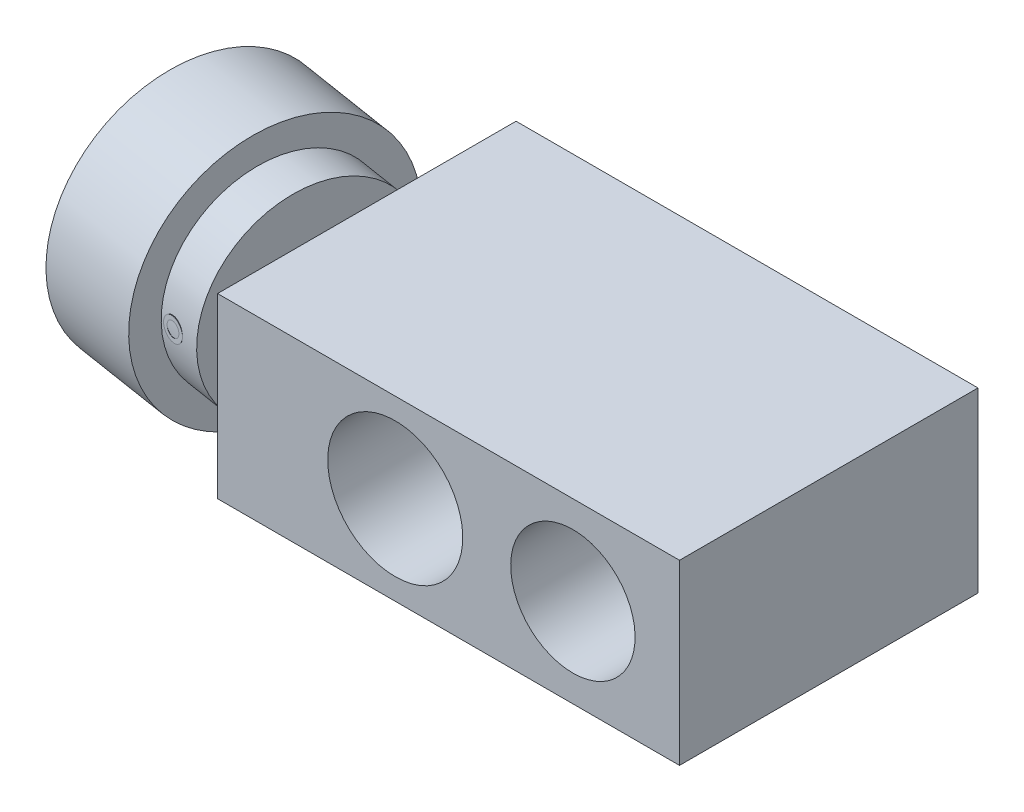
ISO-10303-21;
HEADER;
FILE_DESCRIPTION(('STEP AP214'),'2;1');
FILE_NAME('part.step','',(''),(''),'','','');
FILE_SCHEMA(('AUTOMOTIVE_DESIGN { 1 0 10303 214 1 1 1 1 }'));
ENDSEC;
DATA;
#1=APPLICATION_CONTEXT('core data for automotive mechanical design processes');
#2=APPLICATION_PROTOCOL_DEFINITION('international standard','automotive_design',2000,#1);
#3=PRODUCT_CONTEXT('',#1,'mechanical');
#4=PRODUCT('Part','Part','',(#3));
#5=PRODUCT_RELATED_PRODUCT_CATEGORY('part','',(#4));
#6=PRODUCT_DEFINITION_FORMATION('','',#4);
#7=PRODUCT_DEFINITION_CONTEXT('part definition',#1,'design');
#8=PRODUCT_DEFINITION('design','',#6,#7);
#9=PRODUCT_DEFINITION_SHAPE('','',#8);
#10=(LENGTH_UNIT() NAMED_UNIT(*) SI_UNIT(.MILLI.,.METRE.));
#11=(NAMED_UNIT(*) PLANE_ANGLE_UNIT() SI_UNIT($,.RADIAN.));
#12=(NAMED_UNIT(*) SI_UNIT($,.STERADIAN.) SOLID_ANGLE_UNIT());
#13=UNCERTAINTY_MEASURE_WITH_UNIT(LENGTH_MEASURE(1.E-05),#10,'distance_accuracy_value','');
#14=(GEOMETRIC_REPRESENTATION_CONTEXT(3) GLOBAL_UNCERTAINTY_ASSIGNED_CONTEXT((#13)) GLOBAL_UNIT_ASSIGNED_CONTEXT((#10,
#11,#12)) REPRESENTATION_CONTEXT('',''));
#15=CARTESIAN_POINT('',(0.,0.,0.));
#16=DIRECTION('',(0.,0.,1.));
#17=DIRECTION('',(1.,0.,0.));
#18=AXIS2_PLACEMENT_3D('',#15,#16,#17);
#19=CARTESIAN_POINT('',(-25.,-13.11,22.));
#20=DIRECTION('',(0.,1.,0.));
#21=DIRECTION('',(-1.,0.,0.));
#22=AXIS2_PLACEMENT_3D('',#19,#20,#21);
#23=PLANE('',#22);
#24=DIRECTION('',(0.,0.,1.));
#25=VECTOR('',#24,1.);
#26=CARTESIAN_POINT('',(-26.,-13.11,21.4226497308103));
#27=LINE('',#26,#25);
#28=CARTESIAN_POINT('',(-26.,-13.11,21.4226497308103));
#29=VERTEX_POINT('',#28);
#30=CARTESIAN_POINT('',(-26.,-13.11,22.5773502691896));
#31=VERTEX_POINT('',#30);
#32=EDGE_CURVE('E807',#29,#31,#27,.T.);
#33=ORIENTED_EDGE('',*,*,#32,.F.);
#34=DIRECTION('',(-0.866025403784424,0.,0.50000000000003));
#35=VECTOR('',#34,1.);
#36=CARTESIAN_POINT('',(-25.,-13.11,20.8452994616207));
#37=LINE('',#36,#35);
#38=CARTESIAN_POINT('',(-25.,-13.11,20.8452994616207));
#39=VERTEX_POINT('',#38);
#40=EDGE_CURVE('E809',#39,#29,#37,.T.);
#41=ORIENTED_EDGE('',*,*,#40,.F.);
#42=DIRECTION('',(-0.866025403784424,0.,-0.50000000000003));
#43=VECTOR('',#42,1.);
#44=CARTESIAN_POINT('',(-24.,-13.11,21.4226497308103));
#45=LINE('',#44,#43);
#46=CARTESIAN_POINT('',(-24.,-13.11,21.4226497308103));
#47=VERTEX_POINT('',#46);
#48=EDGE_CURVE('E812',#47,#39,#45,.T.);
#49=ORIENTED_EDGE('',*,*,#48,.F.);
#50=DIRECTION('',(0.,0.,-1.));
#51=VECTOR('',#50,1.);
#52=CARTESIAN_POINT('',(-24.,-13.11,22.5773502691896));
#53=LINE('',#52,#51);
#54=CARTESIAN_POINT('',(-24.,-13.11,22.5773502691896));
#55=VERTEX_POINT('',#54);
#56=EDGE_CURVE('E815',#55,#47,#53,.T.);
#57=ORIENTED_EDGE('',*,*,#56,.F.);
#58=DIRECTION('',(0.866025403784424,0.,-0.50000000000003));
#59=VECTOR('',#58,1.);
#60=CARTESIAN_POINT('',(-25.,-13.11,23.1547005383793));
#61=LINE('',#60,#59);
#62=CARTESIAN_POINT('',(-25.,-13.11,23.1547005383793));
#63=VERTEX_POINT('',#62);
#64=EDGE_CURVE('E33',#63,#55,#61,.T.);
#65=ORIENTED_EDGE('',*,*,#64,.F.);
#66=DIRECTION('',(0.866025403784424,0.,0.50000000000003));
#67=VECTOR('',#66,1.);
#68=CARTESIAN_POINT('',(-26.,-13.11,22.5773502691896));
#69=LINE('',#68,#67);
#70=EDGE_CURVE('E805',#31,#63,#69,.T.);
#71=ORIENTED_EDGE('',*,*,#70,.F.);
#72=EDGE_LOOP('',(#33,#41,#49,#57,#65,#71));
#73=FACE_BOUND('',#72,.T.);
#74=ADVANCED_FACE('F14',(#73),#23,.F.);
#75=CARTESIAN_POINT('',(-24.,-13.11,22.5773502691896));
#76=DIRECTION('',(-1.,0.,0.));
#77=DIRECTION('',(0.,-1.,0.));
#78=AXIS2_PLACEMENT_3D('',#75,#76,#77);
#79=PLANE('',#78);
#80=DIRECTION('',(0.,-1.,0.));
#81=VECTOR('',#80,1.);
#82=CARTESIAN_POINT('',(-24.,-13.11,22.5773502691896));
#83=LINE('',#82,#81);
#84=CARTESIAN_POINT('',(-24.,-14.15,22.5773502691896));
#85=VERTEX_POINT('',#84);
#86=EDGE_CURVE('E787',#55,#85,#83,.T.);
#87=ORIENTED_EDGE('',*,*,#86,.F.);
#88=ORIENTED_EDGE('',*,*,#56,.T.);
#89=DIRECTION('',(0.,-1.,0.));
#90=VECTOR('',#89,1.);
#91=CARTESIAN_POINT('',(-24.,-13.11,21.4226497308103));
#92=LINE('',#91,#90);
#93=CARTESIAN_POINT('',(-24.,-14.15,21.4226497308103));
#94=VERTEX_POINT('',#93);
#95=EDGE_CURVE('E790',#47,#94,#92,.T.);
#96=ORIENTED_EDGE('',*,*,#95,.T.);
#97=DIRECTION('',(0.,0.,1.));
#98=VECTOR('',#97,1.);
#99=CARTESIAN_POINT('',(-24.,-14.15,23.));
#100=LINE('',#99,#98);
#101=EDGE_CURVE('E24',#94,#85,#100,.T.);
#102=ORIENTED_EDGE('',*,*,#101,.T.);
#103=EDGE_LOOP('',(#87,#88,#96,#102));
#104=FACE_BOUND('',#103,.T.);
#105=ADVANCED_FACE('F492',(#104),#79,.T.);
#106=CARTESIAN_POINT('',(-25.,-13.11,23.1547005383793));
#107=DIRECTION('',(-0.50000000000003,0.,-0.866025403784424));
#108=DIRECTION('',(-0.866025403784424,0.,0.50000000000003));
#109=AXIS2_PLACEMENT_3D('',#106,#107,#108);
#110=PLANE('',#109);
#111=DIRECTION('',(0.,-1.,0.));
#112=VECTOR('',#111,1.);
#113=CARTESIAN_POINT('',(-25.,-13.11,23.1547005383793));
#114=LINE('',#113,#112);
#115=CARTESIAN_POINT('',(-25.,-14.15,23.1547005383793));
#116=VERTEX_POINT('',#115);
#117=EDGE_CURVE('E802',#63,#116,#114,.T.);
#118=ORIENTED_EDGE('',*,*,#117,.F.);
#119=ORIENTED_EDGE('',*,*,#64,.T.);
#120=ORIENTED_EDGE('',*,*,#86,.T.);
#121=DIRECTION('',(-0.866025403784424,0.,0.50000000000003));
#122=VECTOR('',#121,1.);
#123=CARTESIAN_POINT('',(-24.9330127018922,-14.15,23.1160254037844));
#124=LINE('',#123,#122);
#125=EDGE_CURVE('E778',#85,#116,#124,.T.);
#126=ORIENTED_EDGE('',*,*,#125,.T.);
#127=EDGE_LOOP('',(#118,#119,#120,#126));
#128=FACE_BOUND('',#127,.T.);
#129=ADVANCED_FACE('F520',(#128),#110,.T.);
#130=CARTESIAN_POINT('',(-26.,-13.11,22.5773502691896));
#131=DIRECTION('',(0.50000000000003,0.,-0.866025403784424));
#132=DIRECTION('',(-0.866025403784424,0.,-0.50000000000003));
#133=AXIS2_PLACEMENT_3D('',#130,#131,#132);
#134=PLANE('',#133);
#135=DIRECTION('',(0.,-1.,0.));
#136=VECTOR('',#135,1.);
#137=CARTESIAN_POINT('',(-26.,-13.11,22.5773502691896));
#138=LINE('',#137,#136);
#139=CARTESIAN_POINT('',(-26.,-14.15,22.5773502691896));
#140=VERTEX_POINT('',#139);
#141=EDGE_CURVE('E799',#31,#140,#138,.T.);
#142=ORIENTED_EDGE('',*,*,#141,.F.);
#143=ORIENTED_EDGE('',*,*,#70,.T.);
#144=ORIENTED_EDGE('',*,*,#117,.T.);
#145=DIRECTION('',(-0.866025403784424,0.,-0.50000000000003));
#146=VECTOR('',#145,1.);
#147=CARTESIAN_POINT('',(-25.0669872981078,-14.15,23.1160254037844));
#148=LINE('',#147,#146);
#149=EDGE_CURVE('E782',#116,#140,#148,.T.);
#150=ORIENTED_EDGE('',*,*,#149,.T.);
#151=EDGE_LOOP('',(#142,#143,#144,#150));
#152=FACE_BOUND('',#151,.T.);
#153=ADVANCED_FACE('F510',(#152),#134,.T.);
#154=CARTESIAN_POINT('',(-26.,-13.11,21.4226497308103));
#155=DIRECTION('',(1.,0.,0.));
#156=DIRECTION('',(0.,1.,0.));
#157=AXIS2_PLACEMENT_3D('',#154,#155,#156);
#158=PLANE('',#157);
#159=ORIENTED_EDGE('',*,*,#32,.T.);
#160=ORIENTED_EDGE('',*,*,#141,.T.);
#161=DIRECTION('',(0.,0.,-1.));
#162=VECTOR('',#161,1.);
#163=CARTESIAN_POINT('',(-26.,-14.15,23.));
#164=LINE('',#163,#162);
#165=CARTESIAN_POINT('',(-26.,-14.15,21.4226497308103));
#166=VERTEX_POINT('',#165);
#167=EDGE_CURVE('E780',#140,#166,#164,.T.);
#168=ORIENTED_EDGE('',*,*,#167,.T.);
#169=DIRECTION('',(0.,-1.,0.));
#170=VECTOR('',#169,1.);
#171=CARTESIAN_POINT('',(-26.,-13.11,21.4226497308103));
#172=LINE('',#171,#170);
#173=EDGE_CURVE('E796',#29,#166,#172,.T.);
#174=ORIENTED_EDGE('',*,*,#173,.F.);
#175=EDGE_LOOP('',(#159,#160,#168,#174));
#176=FACE_BOUND('',#175,.T.);
#177=ADVANCED_FACE('F500',(#176),#158,.T.);
#178=CARTESIAN_POINT('',(-25.,-13.11,20.8452994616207));
#179=DIRECTION('',(0.50000000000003,0.,0.866025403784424));
#180=DIRECTION('',(0.866025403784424,0.,-0.50000000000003));
#181=AXIS2_PLACEMENT_3D('',#178,#179,#180);
#182=PLANE('',#181);
#183=DIRECTION('',(0.,-1.,0.));
#184=VECTOR('',#183,1.);
#185=CARTESIAN_POINT('',(-25.,-13.11,20.8452994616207));
#186=LINE('',#185,#184);
#187=CARTESIAN_POINT('',(-25.,-14.15,20.8452994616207));
#188=VERTEX_POINT('',#187);
#189=EDGE_CURVE('E793',#39,#188,#186,.T.);
#190=ORIENTED_EDGE('',*,*,#189,.F.);
#191=ORIENTED_EDGE('',*,*,#40,.T.);
#192=ORIENTED_EDGE('',*,*,#173,.T.);
#193=DIRECTION('',(0.866025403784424,0.,-0.50000000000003));
#194=VECTOR('',#193,1.);
#195=CARTESIAN_POINT('',(-25.9330127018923,-14.15,21.3839745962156));
#196=LINE('',#195,#194);
#197=EDGE_CURVE('E776',#166,#188,#196,.T.);
#198=ORIENTED_EDGE('',*,*,#197,.T.);
#199=EDGE_LOOP('',(#190,#191,#192,#198));
#200=FACE_BOUND('',#199,.T.);
#201=ADVANCED_FACE('F489',(#200),#182,.T.);
#202=CARTESIAN_POINT('',(-24.,-13.11,21.4226497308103));
#203=DIRECTION('',(-0.50000000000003,0.,0.866025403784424));
#204=DIRECTION('',(0.866025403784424,0.,0.50000000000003));
#205=AXIS2_PLACEMENT_3D('',#202,#203,#204);
#206=PLANE('',#205);
#207=ORIENTED_EDGE('',*,*,#95,.F.);
#208=ORIENTED_EDGE('',*,*,#48,.T.);
#209=ORIENTED_EDGE('',*,*,#189,.T.);
#210=DIRECTION('',(0.866025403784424,0.,0.50000000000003));
#211=VECTOR('',#210,1.);
#212=CARTESIAN_POINT('',(-24.0669872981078,-14.15,21.3839745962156));
#213=LINE('',#212,#211);
#214=EDGE_CURVE('E9',#188,#94,#213,.T.);
#215=ORIENTED_EDGE('',*,*,#214,.T.);
#216=EDGE_LOOP('',(#207,#208,#209,#215));
#217=FACE_BOUND('',#216,.T.);
#218=ADVANCED_FACE('F480',(#217),#206,.T.);
#219=CARTESIAN_POINT('',(-25.,-14.15,23.));
#220=DIRECTION('',(0.,1.,0.));
#221=DIRECTION('',(-1.,0.,0.));
#222=AXIS2_PLACEMENT_3D('',#219,#220,#221);
#223=PLANE('',#222);
#224=CARTESIAN_POINT('',(-25.,-14.15,22.));
#225=DIRECTION('',(0.,1.,0.));
#226=DIRECTION('',(-1.,0.,0.));
#227=AXIS2_PLACEMENT_3D('',#224,#225,#226);
#228=CIRCLE('',#227,1.925);
#229=CARTESIAN_POINT('',(-26.925,-14.15,22.));
#230=VERTEX_POINT('',#229);
#231=EDGE_CURVE('E784',#230,#230,#228,.T.);
#232=ORIENTED_EDGE('',*,*,#231,.F.);
#233=EDGE_LOOP('',(#232));
#234=FACE_BOUND('',#233,.T.);
#235=ORIENTED_EDGE('',*,*,#214,.F.);
#236=ORIENTED_EDGE('',*,*,#197,.F.);
#237=ORIENTED_EDGE('',*,*,#167,.F.);
#238=ORIENTED_EDGE('',*,*,#149,.F.);
#239=ORIENTED_EDGE('',*,*,#125,.F.);
#240=ORIENTED_EDGE('',*,*,#101,.F.);
#241=EDGE_LOOP('',(#235,#236,#237,#238,#239,#240));
#242=FACE_BOUND('',#241,.T.);
#243=ADVANCED_FACE('F461',(#234,#242),#223,.F.);
#244=CARTESIAN_POINT('',(-25.,-12.0103137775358,22.));
#245=DIRECTION('',(0.,1.,0.));
#246=DIRECTION('',(-1.,0.,0.));
#247=AXIS2_PLACEMENT_3D('',#244,#245,#246);
#248=DEGENERATE_TOROIDAL_SURFACE('',#247,0.0423840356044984,2.84999999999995,.T.);
#249=ORIENTED_EDGE('',*,*,#231,.T.);
#250=EDGE_LOOP('',(#249));
#251=FACE_BOUND('',#250,.T.);
#252=CARTESIAN_POINT('',(-25.,-12.5,22.));
#253=DIRECTION('',(0.,-1.,0.));
#254=DIRECTION('',(0.,0.,-1.));
#255=AXIS2_PLACEMENT_3D('',#252,#253,#254);
#256=CIRCLE('',#255,2.85);
#257=CARTESIAN_POINT('',(-25.,-12.5,19.15));
#258=VERTEX_POINT('',#257);
#259=EDGE_CURVE('E226',#258,#258,#256,.F.);
#260=ORIENTED_EDGE('',*,*,#259,.F.);
#261=EDGE_LOOP('',(#260));
#262=FACE_BOUND('',#261,.T.);
#263=ADVANCED_FACE('F466',(#251,#262),#248,.T.);
#264=CARTESIAN_POINT('',(-65.3046702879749,0.,27.2383039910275));
#265=DIRECTION('',(-0.987688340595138,0.,-0.156434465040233));
#266=DIRECTION('',(0.156434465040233,0.,-0.987688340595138));
#267=AXIS2_PLACEMENT_3D('',#264,#265,#266);
#268=PLANE('',#267);
#269=DIRECTION('',(0.13547622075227,0.5,-0.855363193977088));
#270=VECTOR('',#269,1.);
#271=CARTESIAN_POINT('',(-64.9135841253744,1.44337567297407,24.7690831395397));
#272=LINE('',#271,#270);
#273=CARTESIAN_POINT('',(-64.9135841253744,1.44337567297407,24.7690831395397));
#274=VERTEX_POINT('',#273);
#275=CARTESIAN_POINT('',(-64.5224979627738,2.88675134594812,22.2998622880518));
#276=VERTEX_POINT('',#275);
#277=EDGE_CURVE('E713',#274,#276,#272,.T.);
#278=ORIENTED_EDGE('',*,*,#277,.T.);
#279=DIRECTION('',(-0.13547622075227,0.5,0.855363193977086));
#280=VECTOR('',#279,1.);
#281=CARTESIAN_POINT('',(-64.1314118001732,1.44337567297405,19.830641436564));
#282=LINE('',#281,#280);
#283=CARTESIAN_POINT('',(-64.1314118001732,1.44337567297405,19.830641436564));
#284=VERTEX_POINT('',#283);
#285=EDGE_CURVE('E717',#284,#276,#282,.T.);
#286=ORIENTED_EDGE('',*,*,#285,.F.);
#287=DIRECTION('',(0.,1.,0.));
#288=VECTOR('',#287,1.);
#289=CARTESIAN_POINT('',(-64.1314118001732,-1.44337567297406,19.830641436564));
#290=LINE('',#289,#288);
#291=CARTESIAN_POINT('',(-64.1314118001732,-1.44337567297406,19.830641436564));
#292=VERTEX_POINT('',#291);
#293=EDGE_CURVE('E720',#292,#284,#290,.T.);
#294=ORIENTED_EDGE('',*,*,#293,.F.);
#295=DIRECTION('',(-0.135476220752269,-0.5,0.855363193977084));
#296=VECTOR('',#295,1.);
#297=CARTESIAN_POINT('',(-64.1314118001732,-1.44337567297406,19.830641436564));
#298=LINE('',#297,#296);
#299=CARTESIAN_POINT('',(-64.5224979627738,-2.88675134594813,22.2998622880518));
#300=VERTEX_POINT('',#299);
#301=EDGE_CURVE('E723',#292,#300,#298,.T.);
#302=ORIENTED_EDGE('',*,*,#301,.T.);
#303=DIRECTION('',(0.135476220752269,-0.5,-0.855363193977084));
#304=VECTOR('',#303,1.);
#305=CARTESIAN_POINT('',(-64.9135841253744,-1.44337567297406,24.7690831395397));
#306=LINE('',#305,#304);
#307=CARTESIAN_POINT('',(-64.9135841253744,-1.44337567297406,24.7690831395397));
#308=VERTEX_POINT('',#307);
#309=EDGE_CURVE('E726',#308,#300,#306,.T.);
#310=ORIENTED_EDGE('',*,*,#309,.F.);
#311=DIRECTION('',(0.,1.,0.));
#312=VECTOR('',#311,1.);
#313=CARTESIAN_POINT('',(-64.9135841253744,-1.44337567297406,24.7690831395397));
#314=LINE('',#313,#312);
#315=EDGE_CURVE('E698',#308,#274,#314,.T.);
#316=ORIENTED_EDGE('',*,*,#315,.T.);
#317=EDGE_LOOP('',(#278,#286,#294,#302,#310,#316));
#318=FACE_BOUND('',#317,.T.);
#319=ADVANCED_FACE('F244',(#318),#268,.T.);
#320=CARTESIAN_POINT('',(-64.1314118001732,-1.44337567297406,19.830641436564));
#321=DIRECTION('',(-0.156434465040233,0.,0.987688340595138));
#322=DIRECTION('',(0.,-1.,0.));
#323=AXIS2_PLACEMENT_3D('',#320,#321,#322);
#324=PLANE('',#323);
#325=DIRECTION('',(-0.987688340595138,0.,-0.156434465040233));
#326=VECTOR('',#325,1.);
#327=CARTESIAN_POINT('',(-64.1314118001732,1.44337567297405,19.830641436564));
#328=LINE('',#327,#326);
#329=CARTESIAN_POINT('',(-66.600632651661,1.44337567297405,19.4395552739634));
#330=VERTEX_POINT('',#329);
#331=EDGE_CURVE('E733',#284,#330,#328,.T.);
#332=ORIENTED_EDGE('',*,*,#331,.T.);
#333=DIRECTION('',(0.,1.,0.));
#334=VECTOR('',#333,1.);
#335=CARTESIAN_POINT('',(-66.600632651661,-1.44337567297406,19.4395552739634));
#336=LINE('',#335,#334);
#337=CARTESIAN_POINT('',(-66.600632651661,-1.44337567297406,19.4395552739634));
#338=VERTEX_POINT('',#337);
#339=EDGE_CURVE('E702',#338,#330,#336,.T.);
#340=ORIENTED_EDGE('',*,*,#339,.F.);
#341=DIRECTION('',(-0.987688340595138,0.,-0.156434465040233));
#342=VECTOR('',#341,1.);
#343=CARTESIAN_POINT('',(-64.1314118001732,-1.44337567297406,19.830641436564));
#344=LINE('',#343,#342);
#345=EDGE_CURVE('E735',#292,#338,#344,.T.);
#346=ORIENTED_EDGE('',*,*,#345,.F.);
#347=ORIENTED_EDGE('',*,*,#293,.T.);
#348=EDGE_LOOP('',(#332,#340,#346,#347));
#349=FACE_BOUND('',#348,.T.);
#350=ADVANCED_FACE('F554',(#349),#324,.T.);
#351=CARTESIAN_POINT('',(-64.1314118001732,-1.44337567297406,19.830641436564));
#352=DIRECTION('',(0.0782172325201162,-0.866025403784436,-0.493844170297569));
#353=DIRECTION('',(0.135476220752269,0.5,-0.855363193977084));
#354=AXIS2_PLACEMENT_3D('',#351,#352,#353);
#355=PLANE('',#354);
#356=ORIENTED_EDGE('',*,*,#345,.T.);
#357=DIRECTION('',(-0.135476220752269,-0.5,0.855363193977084));
#358=VECTOR('',#357,1.);
#359=CARTESIAN_POINT('',(-66.600632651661,-1.44337567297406,19.4395552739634));
#360=LINE('',#359,#358);
#361=CARTESIAN_POINT('',(-66.9917188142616,-2.88675134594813,21.9087761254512));
#362=VERTEX_POINT('',#361);
#363=EDGE_CURVE('E705',#338,#362,#360,.T.);
#364=ORIENTED_EDGE('',*,*,#363,.T.);
#365=DIRECTION('',(-0.987688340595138,0.,-0.156434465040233));
#366=VECTOR('',#365,1.);
#367=CARTESIAN_POINT('',(-64.5224979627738,-2.88675134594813,22.2998622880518));
#368=LINE('',#367,#366);
#369=EDGE_CURVE('E737',#300,#362,#368,.T.);
#370=ORIENTED_EDGE('',*,*,#369,.F.);
#371=ORIENTED_EDGE('',*,*,#301,.F.);
#372=EDGE_LOOP('',(#356,#364,#370,#371));
#373=FACE_BOUND('',#372,.T.);
#374=ADVANCED_FACE('F564',(#373),#355,.F.);
#375=CARTESIAN_POINT('',(-64.9135841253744,-1.44337567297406,24.7690831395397));
#376=DIRECTION('',(0.0782172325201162,0.866025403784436,-0.493844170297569));
#377=DIRECTION('',(-0.135476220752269,0.5,0.855363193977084));
#378=AXIS2_PLACEMENT_3D('',#375,#376,#377);
#379=PLANE('',#378);
#380=ORIENTED_EDGE('',*,*,#369,.T.);
#381=DIRECTION('',(0.135476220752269,-0.5,-0.855363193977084));
#382=VECTOR('',#381,1.);
#383=CARTESIAN_POINT('',(-67.3828049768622,-1.44337567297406,24.3779969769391));
#384=LINE('',#383,#382);
#385=CARTESIAN_POINT('',(-67.3828049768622,-1.44337567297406,24.3779969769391));
#386=VERTEX_POINT('',#385);
#387=EDGE_CURVE('E708',#386,#362,#384,.T.);
#388=ORIENTED_EDGE('',*,*,#387,.F.);
#389=DIRECTION('',(-0.987688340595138,0.,-0.156434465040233));
#390=VECTOR('',#389,1.);
#391=CARTESIAN_POINT('',(-64.9135841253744,-1.44337567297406,24.7690831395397));
#392=LINE('',#391,#390);
#393=EDGE_CURVE('E739',#308,#386,#392,.T.);
#394=ORIENTED_EDGE('',*,*,#393,.F.);
#395=ORIENTED_EDGE('',*,*,#309,.T.);
#396=EDGE_LOOP('',(#380,#388,#394,#395));
#397=FACE_BOUND('',#396,.T.);
#398=ADVANCED_FACE('F574',(#397),#379,.T.);
#399=CARTESIAN_POINT('',(-64.9135841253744,-1.44337567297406,24.7690831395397));
#400=DIRECTION('',(-0.156434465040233,0.,0.987688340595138));
#401=DIRECTION('',(0.,-1.,0.));
#402=AXIS2_PLACEMENT_3D('',#399,#400,#401);
#403=PLANE('',#402);
#404=ORIENTED_EDGE('',*,*,#393,.T.);
#405=DIRECTION('',(0.,1.,0.));
#406=VECTOR('',#405,1.);
#407=CARTESIAN_POINT('',(-67.3828049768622,-1.44337567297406,24.3779969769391));
#408=LINE('',#407,#406);
#409=CARTESIAN_POINT('',(-67.3828049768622,1.44337567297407,24.3779969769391));
#410=VERTEX_POINT('',#409);
#411=EDGE_CURVE('E198',#386,#410,#408,.T.);
#412=ORIENTED_EDGE('',*,*,#411,.T.);
#413=DIRECTION('',(-0.987688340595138,0.,-0.156434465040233));
#414=VECTOR('',#413,1.);
#415=CARTESIAN_POINT('',(-64.9135841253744,1.44337567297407,24.7690831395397));
#416=LINE('',#415,#414);
#417=EDGE_CURVE('E741',#274,#410,#416,.T.);
#418=ORIENTED_EDGE('',*,*,#417,.F.);
#419=ORIENTED_EDGE('',*,*,#315,.F.);
#420=EDGE_LOOP('',(#404,#412,#418,#419));
#421=FACE_BOUND('',#420,.T.);
#422=ADVANCED_FACE('F584',(#421),#403,.F.);
#423=CARTESIAN_POINT('',(-64.9135841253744,1.44337567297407,24.7690831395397));
#424=DIRECTION('',(-0.0782172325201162,0.86602540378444,0.493844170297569));
#425=DIRECTION('',(-0.13547622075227,-0.5,0.855363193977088));
#426=AXIS2_PLACEMENT_3D('',#423,#424,#425);
#427=PLANE('',#426);
#428=ORIENTED_EDGE('',*,*,#417,.T.);
#429=DIRECTION('',(0.13547622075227,0.5,-0.855363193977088));
#430=VECTOR('',#429,1.);
#431=CARTESIAN_POINT('',(-67.3828049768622,1.44337567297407,24.3779969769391));
#432=LINE('',#431,#430);
#433=CARTESIAN_POINT('',(-66.9917188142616,2.88675134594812,21.9087761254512));
#434=VERTEX_POINT('',#433);
#435=EDGE_CURVE('E696',#410,#434,#432,.T.);
#436=ORIENTED_EDGE('',*,*,#435,.T.);
#437=DIRECTION('',(-0.987688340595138,0.,-0.156434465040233));
#438=VECTOR('',#437,1.);
#439=CARTESIAN_POINT('',(-64.5224979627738,2.88675134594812,22.2998622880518));
#440=LINE('',#439,#438);
#441=EDGE_CURVE('E716',#276,#434,#440,.T.);
#442=ORIENTED_EDGE('',*,*,#441,.F.);
#443=ORIENTED_EDGE('',*,*,#277,.F.);
#444=EDGE_LOOP('',(#428,#436,#442,#443));
#445=FACE_BOUND('',#444,.T.);
#446=ADVANCED_FACE('F594',(#445),#427,.F.);
#447=CARTESIAN_POINT('',(-64.1314118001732,1.44337567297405,19.830641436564));
#448=DIRECTION('',(-0.0782172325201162,-0.866025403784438,0.493844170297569));
#449=DIRECTION('',(0.13547622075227,-0.5,-0.855363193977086));
#450=AXIS2_PLACEMENT_3D('',#447,#448,#449);
#451=PLANE('',#450);
#452=ORIENTED_EDGE('',*,*,#285,.T.);
#453=ORIENTED_EDGE('',*,*,#441,.T.);
#454=DIRECTION('',(-0.13547622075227,0.5,0.855363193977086));
#455=VECTOR('',#454,1.);
#456=CARTESIAN_POINT('',(-66.600632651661,1.44337567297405,19.4395552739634));
#457=LINE('',#456,#455);
#458=EDGE_CURVE('E699',#330,#434,#457,.T.);
#459=ORIENTED_EDGE('',*,*,#458,.F.);
#460=ORIENTED_EDGE('',*,*,#331,.F.);
#461=EDGE_LOOP('',(#452,#453,#459,#460));
#462=FACE_BOUND('',#461,.T.);
#463=ADVANCED_FACE('F604',(#462),#451,.T.);
#464=CARTESIAN_POINT('',(-66.9917188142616,0.,21.9087761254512));
#465=DIRECTION('',(0.987688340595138,0.,0.156434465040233));
#466=DIRECTION('',(-0.156434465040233,0.,0.987688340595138));
#467=AXIS2_PLACEMENT_3D('',#464,#465,#466);
#468=PLANE('',#467);
#469=ORIENTED_EDGE('',*,*,#458,.T.);
#470=ORIENTED_EDGE('',*,*,#435,.F.);
#471=ORIENTED_EDGE('',*,*,#411,.F.);
#472=ORIENTED_EDGE('',*,*,#387,.T.);
#473=ORIENTED_EDGE('',*,*,#363,.F.);
#474=ORIENTED_EDGE('',*,*,#339,.T.);
#475=EDGE_LOOP('',(#469,#470,#471,#472,#473,#474));
#476=FACE_BOUND('',#475,.T.);
#477=CARTESIAN_POINT('',(-66.9917188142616,0.,21.9087761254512));
#478=DIRECTION('',(0.987688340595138,0.,0.156434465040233));
#479=DIRECTION('',(-0.156434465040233,0.,0.987688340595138));
#480=AXIS2_PLACEMENT_3D('',#477,#478,#479);
#481=CIRCLE('',#480,4.);
#482=CARTESIAN_POINT('',(-67.6174566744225,0.,25.8595294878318));
#483=VERTEX_POINT('',#482);
#484=EDGE_CURVE('E742',#483,#483,#481,.T.);
#485=ORIENTED_EDGE('',*,*,#484,.F.);
#486=EDGE_LOOP('',(#485));
#487=FACE_BOUND('',#486,.T.);
#488=ADVANCED_FACE('F614',(#476,#487),#468,.F.);
#489=CARTESIAN_POINT('',(-66.0040304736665,0.,22.0652105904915));
#490=DIRECTION('',(0.987688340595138,0.,0.156434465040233));
#491=DIRECTION('',(-0.156434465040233,0.,0.987688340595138));
#492=AXIS2_PLACEMENT_3D('',#489,#490,#491);
#493=CONICAL_SURFACE('',#492,5.,0.785398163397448);
#494=ORIENTED_EDGE('',*,*,#484,.T.);
#495=EDGE_LOOP('',(#494));
#496=FACE_BOUND('',#495,.T.);
#497=CARTESIAN_POINT('',(-66.0040304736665,0.,22.0652105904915));
#498=DIRECTION('',(0.987688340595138,0.,0.156434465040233));
#499=DIRECTION('',(-0.156434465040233,0.,0.987688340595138));
#500=AXIS2_PLACEMENT_3D('',#497,#498,#499);
#501=CIRCLE('',#500,5.);
#502=CARTESIAN_POINT('',(-66.7862027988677,0.,27.0036522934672));
#503=VERTEX_POINT('',#502);
#504=EDGE_CURVE('E182',#503,#503,#501,.T.);
#505=ORIENTED_EDGE('',*,*,#504,.F.);
#506=EDGE_LOOP('',(#505));
#507=FACE_BOUND('',#506,.T.);
#508=ADVANCED_FACE('F242',(#496,#507),#493,.T.);
#509=CARTESIAN_POINT('',(-74.8932255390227,0.,20.6573004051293));
#510=DIRECTION('',(-0.987688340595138,0.,-0.156434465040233));
#511=DIRECTION('',(0.,-1.,0.));
#512=AXIS2_PLACEMENT_3D('',#509,#510,#511);
#513=CYLINDRICAL_SURFACE('',#512,5.);
#514=ORIENTED_EDGE('',*,*,#504,.T.);
#515=EDGE_LOOP('',(#514));
#516=FACE_BOUND('',#515,.T.);
#517=CARTESIAN_POINT('',(-66.9917188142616,0.,21.9087761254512));
#518=DIRECTION('',(-0.987688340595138,0.,-0.156434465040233));
#519=DIRECTION('',(0.,-1.,0.));
#520=AXIS2_PLACEMENT_3D('',#517,#518,#519);
#521=CIRCLE('',#520,5.);
#522=CARTESIAN_POINT('',(-66.9917188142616,-5.00000000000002,21.9087761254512));
#523=VERTEX_POINT('',#522);
#524=EDGE_CURVE('E149',#523,#523,#521,.T.);
#525=ORIENTED_EDGE('',*,*,#524,.T.);
#526=EDGE_LOOP('',(#525));
#527=FACE_BOUND('',#526,.T.);
#528=ADVANCED_FACE('F238',(#516,#527),#513,.F.);
#529=CARTESIAN_POINT('',(-66.9917188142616,5.,21.9087761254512));
#530=DIRECTION('',(-0.987688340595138,0.,-0.156434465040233));
#531=DIRECTION('',(0.,-1.,0.));
#532=AXIS2_PLACEMENT_3D('',#529,#530,#531);
#533=PLANE('',#532);
#534=CARTESIAN_POINT('',(-66.9917188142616,0.,21.9087761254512));
#535=DIRECTION('',(-0.987688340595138,0.,-0.156434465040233));
#536=DIRECTION('',(0.,-1.,0.));
#537=AXIS2_PLACEMENT_3D('',#534,#535,#536);
#538=CIRCLE('',#537,15.);
#539=CARTESIAN_POINT('',(-66.9917188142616,-15.,21.9087761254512));
#540=VERTEX_POINT('',#539);
#541=EDGE_CURVE('E211',#540,#540,#538,.T.);
#542=ORIENTED_EDGE('',*,*,#541,.T.);
#543=EDGE_LOOP('',(#542));
#544=FACE_BOUND('',#543,.T.);
#545=ORIENTED_EDGE('',*,*,#524,.F.);
#546=EDGE_LOOP('',(#545));
#547=FACE_BOUND('',#546,.T.);
#548=ADVANCED_FACE('F241',(#544,#547),#533,.T.);
#549=CARTESIAN_POINT('',(-74.8932255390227,0.,20.6573004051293));
#550=DIRECTION('',(-0.987688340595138,0.,-0.156434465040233));
#551=DIRECTION('',(0.,-1.,0.));
#552=AXIS2_PLACEMENT_3D('',#549,#550,#551);
#553=CYLINDRICAL_SURFACE('',#552,15.);
#554=CARTESIAN_POINT('',(-74.8932255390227,0.,20.6573004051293));
#555=DIRECTION('',(-0.987688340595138,0.,-0.156434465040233));
#556=DIRECTION('',(0.,-1.,0.));
#557=AXIS2_PLACEMENT_3D('',#554,#555,#556);
#558=CIRCLE('',#557,15.);
#559=CARTESIAN_POINT('',(-74.8932255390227,-15.,20.6573004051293));
#560=VERTEX_POINT('',#559);
#561=EDGE_CURVE('E208',#560,#560,#558,.T.);
#562=ORIENTED_EDGE('',*,*,#561,.T.);
#563=EDGE_LOOP('',(#562));
#564=FACE_BOUND('',#563,.T.);
#565=ORIENTED_EDGE('',*,*,#541,.F.);
#566=EDGE_LOOP('',(#565));
#567=FACE_BOUND('',#566,.T.);
#568=ADVANCED_FACE('F247',(#564,#567),#553,.F.);
#569=CARTESIAN_POINT('',(-100.176051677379,0.,16.6528941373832));
#570=DIRECTION('',(0.987688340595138,0.,0.156434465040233));
#571=DIRECTION('',(-0.156434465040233,0.,0.987688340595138));
#572=AXIS2_PLACEMENT_3D('',#569,#570,#571);
#573=CYLINDRICAL_SURFACE('',#572,14.);
#574=CARTESIAN_POINT('',(-60.2926062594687,0.,37.1443230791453));
#575=CARTESIAN_POINT('',(-60.2926086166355,-0.0560937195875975,37.1443222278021));
#576=CARTESIAN_POINT('',(-60.2972302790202,-0.112226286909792,37.1432457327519));
#577=CARTESIAN_POINT('',(-60.315604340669,-0.222940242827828,37.1389944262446));
#578=CARTESIAN_POINT('',(-60.3293672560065,-0.277519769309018,37.1358171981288));
#579=CARTESIAN_POINT('',(-60.3656384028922,-0.383508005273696,37.1275382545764));
#580=CARTESIAN_POINT('',(-60.3881418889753,-0.434918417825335,37.1224375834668));
#581=CARTESIAN_POINT('',(-60.4412672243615,-0.533131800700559,37.1105836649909));
#582=CARTESIAN_POINT('',(-60.4718872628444,-0.579935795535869,37.1038307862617));
#583=CARTESIAN_POINT('',(-60.5404648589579,-0.667710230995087,37.0890058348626));
#584=CARTESIAN_POINT('',(-60.5784347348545,-0.708670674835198,37.0809315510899));
#585=CARTESIAN_POINT('',(-60.6606355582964,-0.783509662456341,37.0638687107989));
#586=CARTESIAN_POINT('',(-60.7048667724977,-0.817387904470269,37.0548801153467));
#587=CARTESIAN_POINT('',(-60.7984180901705,-0.877133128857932,37.0363958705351));
#588=CARTESIAN_POINT('',(-60.8477435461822,-0.902991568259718,37.026899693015));
#589=CARTESIAN_POINT('',(-60.9500685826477,-0.945908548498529,37.0078177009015));
#590=CARTESIAN_POINT('',(-61.0030681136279,-0.962967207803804,36.9982318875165));
#591=CARTESIAN_POINT('',(-61.1111556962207,-0.987772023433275,36.9793586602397));
#592=CARTESIAN_POINT('',(-61.1662399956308,-0.995534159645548,36.9700707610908));
#593=CARTESIAN_POINT('',(-61.2770214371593,-1.00157493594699,36.9520873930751));
#594=CARTESIAN_POINT('',(-61.3327185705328,-0.99985371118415,36.9433919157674));
#595=CARTESIAN_POINT('',(-61.4430350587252,-0.986989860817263,36.9268459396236));
#596=CARTESIAN_POINT('',(-61.4976562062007,-0.975864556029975,36.9189939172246));
#597=CARTESIAN_POINT('',(-61.6043685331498,-0.944535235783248,36.9042728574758));
#598=CARTESIAN_POINT('',(-61.6564596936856,-0.924331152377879,36.8974038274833));
#599=CARTESIAN_POINT('',(-61.7566703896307,-0.875398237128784,36.8847228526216));
#600=CARTESIAN_POINT('',(-61.8047862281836,-0.846661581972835,36.8789118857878));
#601=CARTESIAN_POINT('',(-61.8956157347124,-0.78148490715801,36.8683692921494));
#602=CARTESIAN_POINT('',(-61.938329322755,-0.745044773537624,36.8636376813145));
#603=CARTESIAN_POINT('',(-62.017215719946,-0.665398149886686,36.8552104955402));
#604=CARTESIAN_POINT('',(-62.053373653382,-0.622176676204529,36.8515172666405));
#605=CARTESIAN_POINT('',(-62.1179803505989,-0.530246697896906,36.8451183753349));
#606=CARTESIAN_POINT('',(-62.1464291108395,-0.48153819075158,36.8424127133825));
#607=CARTESIAN_POINT('',(-62.1947853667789,-0.380007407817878,36.8379181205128));
#608=CARTESIAN_POINT('',(-62.2146922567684,-0.327184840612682,36.8361292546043));
#609=CARTESIAN_POINT('',(-62.2453717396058,-0.218929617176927,36.8334080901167));
#610=CARTESIAN_POINT('',(-62.2561444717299,-0.163497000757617,36.832475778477));
#611=CARTESIAN_POINT('',(-62.2682210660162,-0.0517258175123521,36.8314323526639));
#612=CARTESIAN_POINT('',(-62.2695457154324,0.0046104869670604,36.8313194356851));
#613=CARTESIAN_POINT('',(-62.2627416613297,0.116704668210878,36.8319053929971));
#614=CARTESIAN_POINT('',(-62.2546130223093,0.172462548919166,36.8326042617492));
#615=CARTESIAN_POINT('',(-62.2291579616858,0.281758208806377,36.8348405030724));
#616=CARTESIAN_POINT('',(-62.2118411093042,0.335298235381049,36.8363770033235));
#617=CARTESIAN_POINT('',(-62.1685264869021,0.438707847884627,36.8403422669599));
#618=CARTESIAN_POINT('',(-62.142528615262,0.488577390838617,36.8427710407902));
#619=CARTESIAN_POINT('',(-62.0825591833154,0.583325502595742,36.8485947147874));
#620=CARTESIAN_POINT('',(-62.0485738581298,0.628195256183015,36.8519912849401));
#621=CARTESIAN_POINT('',(-61.973640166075,0.711581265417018,36.8598155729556));
#622=CARTESIAN_POINT('',(-61.9326917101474,0.750097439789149,36.8642433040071));
#623=CARTESIAN_POINT('',(-61.8449313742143,0.819753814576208,36.8741833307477));
#624=CARTESIAN_POINT('',(-61.7981089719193,0.850880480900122,36.8796975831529));
#625=CARTESIAN_POINT('',(-61.7000082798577,0.904781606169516,36.8918068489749));
#626=CARTESIAN_POINT('',(-61.6487300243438,0.927556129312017,36.8984018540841));
#627=CARTESIAN_POINT('',(-61.5432416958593,0.964083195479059,36.9126055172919));
#628=CARTESIAN_POINT('',(-61.4890344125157,0.977844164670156,36.9202132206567));
#629=CARTESIAN_POINT('',(-61.379199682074,0.995980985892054,36.9363117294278));
#630=CARTESIAN_POINT('',(-61.3235722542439,1.00035696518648,36.9448025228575));
#631=CARTESIAN_POINT('',(-61.2126133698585,0.999598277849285,36.9624316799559));
#632=CARTESIAN_POINT('',(-61.1572815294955,0.994484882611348,36.9715685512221));
#633=CARTESIAN_POINT('',(-61.0483549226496,0.974936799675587,36.9902162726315));
#634=CARTESIAN_POINT('',(-60.9947601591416,0.96050209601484,36.999727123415));
#635=CARTESIAN_POINT('',(-60.8908132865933,0.922726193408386,37.0187687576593));
#636=CARTESIAN_POINT('',(-60.8404610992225,0.89938520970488,37.0282995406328));
#637=CARTESIAN_POINT('',(-60.7443975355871,0.84446195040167,37.0469842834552));
#638=CARTESIAN_POINT('',(-60.6986860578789,0.812879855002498,37.0561382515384));
#639=CARTESIAN_POINT('',(-60.6130702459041,0.742291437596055,37.0736740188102));
#640=CARTESIAN_POINT('',(-60.5731784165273,0.703269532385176,37.0820541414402));
#641=CARTESIAN_POINT('',(-60.5004068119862,0.618934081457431,37.097616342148));
#642=CARTESIAN_POINT('',(-60.4675287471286,0.573619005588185,37.1047981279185));
#643=CARTESIAN_POINT('',(-60.40966045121,0.477918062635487,37.117605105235));
#644=CARTESIAN_POINT('',(-60.3846819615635,0.427524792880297,37.1232279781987));
#645=CARTESIAN_POINT('',(-60.3433942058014,0.323187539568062,37.1325997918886));
#646=CARTESIAN_POINT('',(-60.3270748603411,0.269247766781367,37.1363509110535));
#647=CARTESIAN_POINT('',(-60.3077611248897,0.179152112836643,37.1408071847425));
#648=CARTESIAN_POINT('',(-60.302085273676,0.143577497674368,37.1421226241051));
#649=CARTESIAN_POINT('',(-60.2945070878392,0.0720072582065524,37.1438808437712));
#650=CARTESIAN_POINT('',(-60.2926047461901,0.0360116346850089,37.1443236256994));
#651=CARTESIAN_POINT('',(-60.2926062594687,0.,37.1443230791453));
#652=B_SPLINE_CURVE_WITH_KNOTS('',3,(#574,#575,#576,#577,#578,#579,#580,#581,#582,#583,#584,
#585,#586,#587,#588,#589,#590,#591,#592,#593,#594,#595,#596,#597,#598,#599,#600,#601,#602,#603,
#604,#605,#606,#607,#608,#609,#610,#611,#612,#613,#614,#615,#616,#617,#618,#619,#620,#621,#622,
#623,#624,#625,#626,#627,#628,#629,#630,#631,#632,#633,#634,#635,#636,#637,#638,#639,#640,#641,
#642,#643,#644,#645,#646,#647,#648,#649,#650,#651),.UNSPECIFIED.,.T.,.F.,(4,2,2,2,2,2,2,2,2,2,2,
2,2,2,2,2,2,2,2,2,2,2,2,2,2,2,2,2,2,2,2,2,2,2,2,2,2,2,4),(0.,0.168149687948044,
0.336493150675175,0.504745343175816,0.672960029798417,0.841459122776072,1.00996539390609,
1.17865055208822,1.34733343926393,1.51572595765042,1.68411607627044,1.85219672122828,
2.02027862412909,2.18851511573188,2.35675409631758,2.52537018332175,2.69398634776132,
2.86261446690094,3.03124001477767,3.19949444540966,3.36774772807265,3.53582612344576,
3.7039064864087,3.87227865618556,4.040652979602,4.20933334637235,4.37801241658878,
4.54653357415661,4.71505244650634,4.88319402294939,5.05133588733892,5.21947368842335,
5.3876078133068,5.55609805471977,5.7246293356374,5.89340994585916,6.06199366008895,
6.16994436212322,6.27789486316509),.UNSPECIFIED.);
#653=CARTESIAN_POINT('',(-60.2926062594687,0.,37.1443230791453));
#654=VERTEX_POINT('',#653);
#655=CARTESIAN_POINT('',(-62.2679829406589,0.,36.8314541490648));
#656=VERTEX_POINT('',#655);
#657=EDGE_CURVE('E194',#654,#656,#652,.T.);
#658=ORIENTED_EDGE('',*,*,#657,.F.);
#659=EDGE_CURVE('E682',#656,#654,#652,.T.);
#660=ORIENTED_EDGE('',*,*,#659,.F.);
#661=EDGE_LOOP('',(#658,#660));
#662=FACE_BOUND('',#661,.T.);
#663=ADVANCED_FACE('F251',(#662),#573,.T.);
#664=CARTESIAN_POINT('',(-74.8932255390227,15.,20.6573004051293));
#665=DIRECTION('',(-0.987688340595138,0.,-0.156434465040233));
#666=DIRECTION('',(0.,-1.,0.));
#667=AXIS2_PLACEMENT_3D('',#664,#665,#666);
#668=PLANE('',#667);
#669=CARTESIAN_POINT('',(-74.8932255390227,0.,20.6573004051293));
#670=DIRECTION('',(-0.987688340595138,0.,-0.156434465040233));
#671=DIRECTION('',(0.,-1.,0.));
#672=AXIS2_PLACEMENT_3D('',#669,#670,#671);
#673=CIRCLE('',#672,18.);
#674=CARTESIAN_POINT('',(-74.8932255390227,-18.,20.6573004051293));
#675=VERTEX_POINT('',#674);
#676=EDGE_CURVE('E205',#675,#675,#673,.T.);
#677=ORIENTED_EDGE('',*,*,#676,.T.);
#678=EDGE_LOOP('',(#677));
#679=FACE_BOUND('',#678,.T.);
#680=ORIENTED_EDGE('',*,*,#561,.F.);
#681=EDGE_LOOP('',(#680));
#682=FACE_BOUND('',#681,.T.);
#683=ADVANCED_FACE('F253',(#679,#682),#668,.T.);
#684=CARTESIAN_POINT('',(-61.2802946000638,0.,36.987888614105));
#685=DIRECTION('',(0.156434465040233,0.,-0.987688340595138));
#686=DIRECTION('',(0.987688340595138,0.,0.156434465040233));
#687=AXIS2_PLACEMENT_3D('',#684,#685,#686);
#688=CYLINDRICAL_SURFACE('',#687,1.);
#689=CARTESIAN_POINT('',(-61.2802946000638,0.,36.987888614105));
#690=DIRECTION('',(0.156434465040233,0.,-0.987688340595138));
#691=DIRECTION('',(0.987688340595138,0.,0.156434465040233));
#692=AXIS2_PLACEMENT_3D('',#689,#690,#691);
#693=CIRCLE('',#692,1.);
#694=EDGE_CURVE('E218',#656,#654,#693,.T.);
#695=ORIENTED_EDGE('',*,*,#694,.F.);
#696=ORIENTED_EDGE('',*,*,#659,.T.);
#697=EDGE_LOOP('',(#695,#696));
#698=FACE_BOUND('',#697,.T.);
#699=ADVANCED_FACE('F256',(#698),#688,.F.);
#700=EDGE_CURVE('E689',#654,#656,#693,.T.);
#701=ORIENTED_EDGE('',*,*,#700,.F.);
#702=ORIENTED_EDGE('',*,*,#657,.T.);
#703=EDGE_LOOP('',(#701,#702));
#704=FACE_BOUND('',#703,.T.);
#705=ADVANCED_FACE('F261',(#704),#688,.F.);
#706=CARTESIAN_POINT('',(-74.8932255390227,0.,20.6573004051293));
#707=DIRECTION('',(-0.987688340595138,0.,-0.156434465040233));
#708=DIRECTION('',(0.,-1.,0.));
#709=AXIS2_PLACEMENT_3D('',#706,#707,#708);
#710=CYLINDRICAL_SURFACE('',#709,18.);
#711=CARTESIAN_POINT('',(-61.0655887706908,0.,22.8473829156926));
#712=DIRECTION('',(-0.987688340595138,0.,-0.156434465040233));
#713=DIRECTION('',(0.,-1.,0.));
#714=AXIS2_PLACEMENT_3D('',#711,#712,#713);
#715=CIRCLE('',#714,18.);
#716=CARTESIAN_POINT('',(-61.0655887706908,-18.,22.8473829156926));
#717=VERTEX_POINT('',#716);
#718=EDGE_CURVE('E202',#717,#717,#715,.T.);
#719=ORIENTED_EDGE('',*,*,#718,.T.);
#720=EDGE_LOOP('',(#719));
#721=FACE_BOUND('',#720,.T.);
#722=ORIENTED_EDGE('',*,*,#676,.F.);
#723=EDGE_LOOP('',(#722));
#724=FACE_BOUND('',#723,.T.);
#725=ADVANCED_FACE('F258',(#721,#724),#710,.T.);
#726=CARTESIAN_POINT('',(-61.2802946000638,0.,36.987888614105));
#727=DIRECTION('',(0.156434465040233,0.,-0.987688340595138));
#728=DIRECTION('',(0.987688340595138,0.,0.156434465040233));
#729=AXIS2_PLACEMENT_3D('',#726,#727,#728);
#730=PLANE('',#729);
#731=ORIENTED_EDGE('',*,*,#700,.T.);
#732=ORIENTED_EDGE('',*,*,#694,.T.);
#733=EDGE_LOOP('',(#731,#732));
#734=FACE_BOUND('',#733,.T.);
#735=CARTESIAN_POINT('',(-61.2802946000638,0.,36.987888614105));
#736=DIRECTION('',(0.156434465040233,0.,-0.987688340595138));
#737=DIRECTION('',(0.987688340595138,0.,0.156434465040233));
#738=AXIS2_PLACEMENT_3D('',#735,#736,#737);
#739=CIRCLE('',#738,1.6);
#740=CARTESIAN_POINT('',(-62.860595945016,0.,36.7375934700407));
#741=VERTEX_POINT('',#740);
#742=CARTESIAN_POINT('',(-59.6999932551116,0.,37.2381837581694));
#743=VERTEX_POINT('',#742);
#744=EDGE_CURVE('E692',#741,#743,#739,.T.);
#745=ORIENTED_EDGE('',*,*,#744,.F.);
#746=EDGE_CURVE('E693',#743,#741,#739,.T.);
#747=ORIENTED_EDGE('',*,*,#746,.F.);
#748=EDGE_LOOP('',(#745,#747));
#749=FACE_BOUND('',#748,.T.);
#750=ADVANCED_FACE('F260',(#734,#749),#730,.F.);
#751=CARTESIAN_POINT('',(-61.0655887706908,14.,22.8473829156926));
#752=DIRECTION('',(-0.987688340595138,0.,-0.156434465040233));
#753=DIRECTION('',(0.,-1.,0.));
#754=AXIS2_PLACEMENT_3D('',#751,#752,#753);
#755=PLANE('',#754);
#756=ORIENTED_EDGE('',*,*,#718,.F.);
#757=EDGE_LOOP('',(#756));
#758=FACE_BOUND('',#757,.T.);
#759=CARTESIAN_POINT('',(-61.0655887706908,0.,22.8473829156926));
#760=DIRECTION('',(-0.987688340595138,0.,-0.156434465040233));
#761=DIRECTION('',(0.,-1.,0.));
#762=AXIS2_PLACEMENT_3D('',#759,#760,#761);
#763=CIRCLE('',#762,14.);
#764=CARTESIAN_POINT('',(-61.0655887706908,-14.,22.8473829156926));
#765=VERTEX_POINT('',#764);
#766=EDGE_CURVE('E199',#765,#765,#763,.T.);
#767=ORIENTED_EDGE('',*,*,#766,.T.);
#768=EDGE_LOOP('',(#767));
#769=FACE_BOUND('',#768,.T.);
#770=ADVANCED_FACE('F263',(#758,#769),#755,.F.);
#771=CARTESIAN_POINT('',(-61.2802946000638,0.,36.987888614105));
#772=DIRECTION('',(0.156434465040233,0.,-0.987688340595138));
#773=DIRECTION('',(0.987688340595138,0.,0.156434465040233));
#774=AXIS2_PLACEMENT_3D('',#771,#772,#773);
#775=CYLINDRICAL_SURFACE('',#774,1.6);
#776=CARTESIAN_POINT('',(-62.860595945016,0.,36.7375934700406));
#777=CARTESIAN_POINT('',(-62.860591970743,0.0895594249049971,36.7375929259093));
#778=CARTESIAN_POINT('',(-62.8530080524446,0.179176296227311,36.73791596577));
#779=CARTESIAN_POINT('',(-62.8228825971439,0.355920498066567,36.73926876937));
#780=CARTESIAN_POINT('',(-62.8003250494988,0.443045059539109,36.7402992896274));
#781=CARTESIAN_POINT('',(-62.740954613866,0.612219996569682,36.7432424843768));
#782=CARTESIAN_POINT('',(-62.7041508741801,0.694273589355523,36.7451545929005));
#783=CARTESIAN_POINT('',(-62.6174018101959,0.85104848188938,36.7501212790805));
#784=CARTESIAN_POINT('',(-62.5674589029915,0.925771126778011,36.7531756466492));
#785=CARTESIAN_POINT('',(-62.4556635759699,1.0661262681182,36.7607494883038));
#786=CARTESIAN_POINT('',(-62.3937627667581,1.13171990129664,36.7652749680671));
#787=CARTESIAN_POINT('',(-62.2599827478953,1.25162063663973,36.7760936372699));
#788=CARTESIAN_POINT('',(-62.1881030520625,1.30592718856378,36.7823869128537));
#789=CARTESIAN_POINT('',(-62.0362242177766,1.40185400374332,36.797006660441));
#790=CARTESIAN_POINT('',(-61.9562029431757,1.44343837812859,36.8053387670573));
#791=CARTESIAN_POINT('',(-61.7905277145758,1.51251124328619,36.8241553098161));
#792=CARTESIAN_POINT('',(-61.7048739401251,1.5400001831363,36.8346396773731));
#793=CARTESIAN_POINT('',(-61.5308035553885,1.57998496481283,36.8576706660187));
#794=CARTESIAN_POINT('',(-61.4424006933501,1.59254596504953,36.8702080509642));
#795=CARTESIAN_POINT('',(-61.2650269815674,1.60251983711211,36.8971415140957));
#796=CARTESIAN_POINT('',(-61.176056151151,1.59993322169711,36.9115375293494));
#797=CARTESIAN_POINT('',(-61.0005133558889,1.57973887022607,36.9416774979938));
#798=CARTESIAN_POINT('',(-60.9139319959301,1.56220261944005,36.9574147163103));
#799=CARTESIAN_POINT('',(-60.7451472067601,1.51271818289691,36.9896827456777));
#800=CARTESIAN_POINT('',(-60.6629438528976,1.4807697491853,37.0062135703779));
#801=CARTESIAN_POINT('',(-60.5049832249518,1.40329006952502,37.0393550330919));
#802=CARTESIAN_POINT('',(-60.4292413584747,1.35772746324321,37.0559657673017));
#803=CARTESIAN_POINT('',(-60.2864577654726,1.25433527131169,37.0883880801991));
#804=CARTESIAN_POINT('',(-60.2194163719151,1.19650521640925,37.1041996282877));
#805=CARTESIAN_POINT('',(-60.0954647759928,1.06982212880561,37.1342483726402));
#806=CARTESIAN_POINT('',(-60.0386152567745,1.00090742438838,37.148475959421));
#807=CARTESIAN_POINT('',(-59.9370602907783,0.854224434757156,37.1744212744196));
#808=CARTESIAN_POINT('',(-59.8923548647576,0.776456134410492,37.1861389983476));
#809=CARTESIAN_POINT('',(-59.8162981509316,0.614228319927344,37.2063526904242));
#810=CARTESIAN_POINT('',(-59.7849502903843,0.529767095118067,37.2148478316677));
#811=CARTESIAN_POINT('',(-59.7364986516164,0.356572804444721,37.2280749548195));
#812=CARTESIAN_POINT('',(-59.7193943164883,0.26783990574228,37.2328070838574));
#813=CARTESIAN_POINT('',(-59.6999656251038,0.0891526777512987,37.2381877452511));
#814=CARTESIAN_POINT('',(-59.6975591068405,-0.000792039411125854,37.2388589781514));
#815=CARTESIAN_POINT('',(-59.7073743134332,-0.179816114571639,37.2361352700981));
#816=CARTESIAN_POINT('',(-59.7195957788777,-0.268895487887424,37.2327404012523));
#817=CARTESIAN_POINT('',(-59.758270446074,-0.443412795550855,37.2221173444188));
#818=CARTESIAN_POINT('',(-59.7846847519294,-0.528859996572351,37.2148996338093));
#819=CARTESIAN_POINT('',(-59.8509936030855,-0.69397648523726,37.1970899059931));
#820=CARTESIAN_POINT('',(-59.8908885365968,-0.773645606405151,37.186497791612));
#821=CARTESIAN_POINT('',(-59.9832821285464,-0.925324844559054,37.1625310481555));
#822=CARTESIAN_POINT('',(-60.0358347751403,-0.997300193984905,37.1491445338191));
#823=CARTESIAN_POINT('',(-60.1520414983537,-1.131195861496,37.1204046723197));
#824=CARTESIAN_POINT('',(-60.2156959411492,-1.19311584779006,37.105051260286));
#825=CARTESIAN_POINT('',(-60.3527304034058,-1.30544071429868,37.0731600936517));
#826=CARTESIAN_POINT('',(-60.426155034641,-1.35578969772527,37.0566170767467));
#827=CARTESIAN_POINT('',(-60.5804977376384,-1.44315804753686,37.0232852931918));
#828=CARTESIAN_POINT('',(-60.6614156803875,-1.48017764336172,37.0064965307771));
#829=CARTESIAN_POINT('',(-60.8283187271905,-1.53974446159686,36.9735192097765));
#830=CARTESIAN_POINT('',(-60.914292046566,-1.56232399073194,36.9573293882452));
#831=CARTESIAN_POINT('',(-61.0890481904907,-1.59247413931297,36.9261895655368));
#832=CARTESIAN_POINT('',(-61.1778309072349,-1.60004533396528,36.9112395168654));
#833=CARTESIAN_POINT('',(-61.3551485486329,-1.59995451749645,36.883165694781));
#834=CARTESIAN_POINT('',(-61.4436819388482,-1.59238031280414,36.8700318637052));
#835=CARTESIAN_POINT('',(-61.6184839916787,-1.56239880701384,36.8457877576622));
#836=CARTESIAN_POINT('',(-61.7047526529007,-1.53999149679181,36.8346774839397));
#837=CARTESIAN_POINT('',(-61.8725360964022,-1.48100586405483,36.8145840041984));
#838=CARTESIAN_POINT('',(-61.9540520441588,-1.44443103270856,36.8056002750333));
#839=CARTESIAN_POINT('',(-62.1100310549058,-1.35815733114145,36.7896821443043));
#840=CARTESIAN_POINT('',(-62.1844940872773,-1.30845840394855,36.7827477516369));
#841=CARTESIAN_POINT('',(-62.3246394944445,-1.19701942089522,36.7706881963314));
#842=CARTESIAN_POINT('',(-62.3902706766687,-1.13521386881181,36.7655733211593));
#843=CARTESIAN_POINT('',(-62.5103740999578,-1.00145049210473,36.7569149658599));
#844=CARTESIAN_POINT('',(-62.5648436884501,-0.929490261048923,36.7533718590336));
#845=CARTESIAN_POINT('',(-62.6611565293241,-0.777200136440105,36.7475342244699));
#846=CARTESIAN_POINT('',(-62.7029587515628,-0.696844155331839,36.7452437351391));
#847=CARTESIAN_POINT('',(-62.7723994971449,-0.530278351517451,36.7416413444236));
#848=CARTESIAN_POINT('',(-62.80005367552,-0.44407511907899,36.7403283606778));
#849=CARTESIAN_POINT('',(-62.833626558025,-0.297838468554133,36.7387809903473));
#850=CARTESIAN_POINT('',(-62.8437252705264,-0.23873330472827,36.7383324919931));
#851=CARTESIAN_POINT('',(-62.8572112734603,-0.119760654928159,36.7377389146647));
#852=CARTESIAN_POINT('',(-62.8605986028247,-0.0598931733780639,36.7375938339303));
#853=CARTESIAN_POINT('',(-62.860595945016,0.,36.7375934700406));
#854=B_SPLINE_CURVE_WITH_KNOTS('',3,(#776,#777,#778,#779,#780,#781,#782,#783,#784,#785,#786,
#787,#788,#789,#790,#791,#792,#793,#794,#795,#796,#797,#798,#799,#800,#801,#802,#803,#804,#805,
#806,#807,#808,#809,#810,#811,#812,#813,#814,#815,#816,#817,#818,#819,#820,#821,#822,#823,#824,
#825,#826,#827,#828,#829,#830,#831,#832,#833,#834,#835,#836,#837,#838,#839,#840,#841,#842,#843,
#844,#845,#846,#847,#848,#849,#850,#851,#852,#853),.UNSPECIFIED.,.T.,.F.,(4,2,2,2,2,2,2,2,2,2,2,
2,2,2,2,2,2,2,2,2,2,2,2,2,2,2,2,2,2,2,2,2,2,2,2,2,2,2,4),(0.,0.268459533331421,
0.537206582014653,0.805781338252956,1.07430672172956,1.34394239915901,1.61359121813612,
1.88399383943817,2.15438784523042,2.42359723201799,2.69279750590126,2.96071770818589,
3.22864252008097,3.49718931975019,3.76574639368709,4.03585289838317,4.30595986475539,
4.57613609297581,4.84630175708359,5.11495578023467,5.38360503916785,5.65152178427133,
5.91944624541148,6.18853436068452,6.45763135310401,6.72800217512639,6.99836834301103,
7.2681274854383,7.53787628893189,7.80606574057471,8.07425535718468,8.34237892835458,
8.61050366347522,8.88012113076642,9.14980259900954,9.42034846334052,9.69059431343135,
9.87012859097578,10.0496618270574),.UNSPECIFIED.);
#855=EDGE_CURVE('E227',#743,#741,#854,.T.);
#856=ORIENTED_EDGE('',*,*,#855,.F.);
#857=ORIENTED_EDGE('',*,*,#746,.T.);
#858=EDGE_LOOP('',(#856,#857));
#859=FACE_BOUND('',#858,.T.);
#860=ADVANCED_FACE('F265',(#859),#775,.T.);
#861=EDGE_CURVE('E219',#741,#743,#854,.T.);
#862=ORIENTED_EDGE('',*,*,#861,.F.);
#863=ORIENTED_EDGE('',*,*,#744,.T.);
#864=EDGE_LOOP('',(#862,#863));
#865=FACE_BOUND('',#864,.T.);
#866=ADVANCED_FACE('F273',(#865),#775,.T.);
#867=CARTESIAN_POINT('',(-74.8932255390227,0.,20.6573004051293));
#868=DIRECTION('',(-0.987688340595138,0.,-0.156434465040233));
#869=DIRECTION('',(0.,-1.,0.));
#870=AXIS2_PLACEMENT_3D('',#867,#868,#869);
#871=CYLINDRICAL_SURFACE('',#870,14.);
#872=ORIENTED_EDGE('',*,*,#861,.T.);
#873=ORIENTED_EDGE('',*,*,#855,.T.);
#874=EDGE_LOOP('',(#872,#873));
#875=FACE_BOUND('',#874,.T.);
#876=ORIENTED_EDGE('',*,*,#766,.F.);
#877=EDGE_LOOP('',(#876));
#878=FACE_BOUND('',#877,.T.);
#879=CARTESIAN_POINT('',(-55.13945872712,0.,23.785989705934));
#880=DIRECTION('',(-0.987688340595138,0.,-0.156434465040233));
#881=DIRECTION('',(0.,-1.,0.));
#882=AXIS2_PLACEMENT_3D('',#879,#880,#881);
#883=CIRCLE('',#882,14.);
#884=CARTESIAN_POINT('',(-55.13945872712,-14.,23.785989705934));
#885=VERTEX_POINT('',#884);
#886=EDGE_CURVE('E195',#885,#885,#883,.T.);
#887=ORIENTED_EDGE('',*,*,#886,.T.);
#888=EDGE_LOOP('',(#887));
#889=FACE_BOUND('',#888,.T.);
#890=ADVANCED_FACE('F229',(#875,#878,#889),#871,.T.);
#891=CARTESIAN_POINT('',(-55.13945872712,5.,23.785989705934));
#892=DIRECTION('',(-0.987688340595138,0.,-0.156434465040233));
#893=DIRECTION('',(0.,-1.,0.));
#894=AXIS2_PLACEMENT_3D('',#891,#892,#893);
#895=PLANE('',#894);
#896=ORIENTED_EDGE('',*,*,#886,.F.);
#897=EDGE_LOOP('',(#896));
#898=FACE_BOUND('',#897,.T.);
#899=CARTESIAN_POINT('',(-55.13945872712,0.,23.785989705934));
#900=DIRECTION('',(-0.987688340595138,0.,-0.156434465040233));
#901=DIRECTION('',(0.,-1.,0.));
#902=AXIS2_PLACEMENT_3D('',#899,#900,#901);
#903=CIRCLE('',#902,5.);
#904=CARTESIAN_POINT('',(-55.13945872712,-5.00000000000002,23.785989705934));
#905=VERTEX_POINT('',#904);
#906=EDGE_CURVE('E181',#905,#905,#903,.T.);
#907=ORIENTED_EDGE('',*,*,#906,.T.);
#908=EDGE_LOOP('',(#907));
#909=FACE_BOUND('',#908,.T.);
#910=ADVANCED_FACE('F281',(#898,#909),#895,.F.);
#911=CARTESIAN_POINT('',(0.,-6.,20.));
#912=DIRECTION('',(0.,0.,-1.));
#913=DIRECTION('',(0.,1.,0.));
#914=AXIS2_PLACEMENT_3D('',#911,#912,#913);
#915=PLANE('',#914);
#916=CARTESIAN_POINT('',(0.,0.,20.));
#917=DIRECTION('',(0.,0.,1.));
#918=DIRECTION('',(0.,-1.,0.));
#919=AXIS2_PLACEMENT_3D('',#916,#917,#918);
#920=CIRCLE('',#919,6.);
#921=CARTESIAN_POINT('',(0.,-6.,20.));
#922=VERTEX_POINT('',#921);
#923=EDGE_CURVE('E185',#922,#922,#920,.T.);
#924=ORIENTED_EDGE('',*,*,#923,.F.);
#925=EDGE_LOOP('',(#924));
#926=FACE_BOUND('',#925,.T.);
#927=CARTESIAN_POINT('',(0.,0.,20.));
#928=DIRECTION('',(0.,0.,1.));
#929=DIRECTION('',(0.,-1.,0.));
#930=AXIS2_PLACEMENT_3D('',#927,#928,#929);
#931=CIRCLE('',#930,8.75);
#932=CARTESIAN_POINT('',(0.,-8.75,20.));
#933=VERTEX_POINT('',#932);
#934=EDGE_CURVE('E188',#933,#933,#931,.T.);
#935=ORIENTED_EDGE('',*,*,#934,.T.);
#936=EDGE_LOOP('',(#935));
#937=FACE_BOUND('',#936,.T.);
#938=ADVANCED_FACE('F294',(#926,#937),#915,.F.);
#939=CARTESIAN_POINT('',(-25.,0.,7.));
#940=DIRECTION('',(0.,0.,-1.));
#941=DIRECTION('',(0.,1.,0.));
#942=AXIS2_PLACEMENT_3D('',#939,#940,#941);
#943=PLANE('',#942);
#944=CARTESIAN_POINT('',(-25.,0.,7.));
#945=DIRECTION('',(0.,0.,1.));
#946=DIRECTION('',(0.,-1.,0.));
#947=AXIS2_PLACEMENT_3D('',#944,#945,#946);
#948=CIRCLE('',#947,9.5);
#949=CARTESIAN_POINT('',(-25.,-9.5,7.));
#950=VERTEX_POINT('',#949);
#951=EDGE_CURVE('E154',#950,#950,#948,.T.);
#952=ORIENTED_EDGE('',*,*,#951,.T.);
#953=EDGE_LOOP('',(#952));
#954=FACE_BOUND('',#953,.T.);
#955=ADVANCED_FACE('F300',(#954),#943,.F.);
#956=CARTESIAN_POINT('',(0.,0.,42.));
#957=DIRECTION('',(0.,0.,1.));
#958=DIRECTION('',(0.,-1.,0.));
#959=AXIS2_PLACEMENT_3D('',#956,#957,#958);
#960=CYLINDRICAL_SURFACE('',#959,6.);
#961=CARTESIAN_POINT('',(0.,0.,0.));
#962=DIRECTION('',(0.,0.,1.));
#963=DIRECTION('',(0.,-1.,0.));
#964=AXIS2_PLACEMENT_3D('',#961,#962,#963);
#965=CIRCLE('',#964,6.);
#966=CARTESIAN_POINT('',(0.,-6.,0.));
#967=VERTEX_POINT('',#966);
#968=EDGE_CURVE('E177',#967,#967,#965,.T.);
#969=ORIENTED_EDGE('',*,*,#968,.F.);
#970=EDGE_LOOP('',(#969));
#971=FACE_BOUND('',#970,.T.);
#972=ORIENTED_EDGE('',*,*,#923,.T.);
#973=EDGE_LOOP('',(#972));
#974=FACE_BOUND('',#973,.T.);
#975=ADVANCED_FACE('F304',(#971,#974),#960,.F.);
#976=CARTESIAN_POINT('',(-66.7447967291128,0.,21.9478847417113));
#977=DIRECTION('',(0.987688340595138,0.,0.156434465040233));
#978=DIRECTION('',(-0.156434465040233,0.,0.987688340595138));
#979=AXIS2_PLACEMENT_3D('',#976,#977,#978);
#980=CYLINDRICAL_SURFACE('',#979,5.);
#981=CARTESIAN_POINT('',(-50.,0.,24.6));
#982=DIRECTION('',(-1.,0.,0.));
#983=DIRECTION('',(0.,0.,1.));
#984=AXIS2_PLACEMENT_3D('',#981,#982,#983);
#985=ELLIPSE('',#984,5.06232562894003,5.);
#986=CARTESIAN_POINT('',(-50.,0.,29.66232562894));
#987=VERTEX_POINT('',#986);
#988=EDGE_CURVE('E178',#987,#987,#985,.T.);
#989=ORIENTED_EDGE('',*,*,#988,.T.);
#990=EDGE_LOOP('',(#989));
#991=FACE_BOUND('',#990,.T.);
#992=ORIENTED_EDGE('',*,*,#906,.F.);
#993=EDGE_LOOP('',(#992));
#994=FACE_BOUND('',#993,.T.);
#995=ADVANCED_FACE('F236',(#991,#994),#980,.T.);
#996=CARTESIAN_POINT('',(0.,0.,42.));
#997=DIRECTION('',(0.,0.,1.));
#998=DIRECTION('',(0.,-1.,0.));
#999=AXIS2_PLACEMENT_3D('',#996,#997,#998);
#1000=CYLINDRICAL_SURFACE('',#999,8.75);
#1001=ORIENTED_EDGE('',*,*,#934,.F.);
#1002=EDGE_LOOP('',(#1001));
#1003=FACE_BOUND('',#1002,.T.);
#1004=CARTESIAN_POINT('',(0.,0.,42.));
#1005=DIRECTION('',(0.,0.,1.));
#1006=DIRECTION('',(0.,-1.,0.));
#1007=AXIS2_PLACEMENT_3D('',#1004,#1005,#1006);
#1008=CIRCLE('',#1007,8.75);
#1009=CARTESIAN_POINT('',(0.,-8.75,42.));
#1010=VERTEX_POINT('',#1009);
#1011=EDGE_CURVE('E191',#1010,#1010,#1008,.T.);
#1012=ORIENTED_EDGE('',*,*,#1011,.T.);
#1013=EDGE_LOOP('',(#1012));
#1014=FACE_BOUND('',#1013,.T.);
#1015=ADVANCED_FACE('F303',(#1003,#1014),#1000,.F.);
#1016=CARTESIAN_POINT('',(-25.,0.,42.));
#1017=DIRECTION('',(0.,0.,1.));
#1018=DIRECTION('',(0.,-1.,0.));
#1019=AXIS2_PLACEMENT_3D('',#1016,#1017,#1018);
#1020=CYLINDRICAL_SURFACE('',#1019,9.5);
#1021=ORIENTED_EDGE('',*,*,#951,.F.);
#1022=EDGE_LOOP('',(#1021));
#1023=FACE_BOUND('',#1022,.T.);
#1024=CARTESIAN_POINT('',(-25.,0.,42.));
#1025=DIRECTION('',(0.,0.,1.));
#1026=DIRECTION('',(0.,-1.,0.));
#1027=AXIS2_PLACEMENT_3D('',#1024,#1025,#1026);
#1028=CIRCLE('',#1027,9.5);
#1029=CARTESIAN_POINT('',(-25.,-9.5,42.));
#1030=VERTEX_POINT('',#1029);
#1031=EDGE_CURVE('E158',#1030,#1030,#1028,.T.);
#1032=ORIENTED_EDGE('',*,*,#1031,.T.);
#1033=EDGE_LOOP('',(#1032));
#1034=FACE_BOUND('',#1033,.T.);
#1035=ADVANCED_FACE('F309',(#1023,#1034),#1020,.F.);
#1036=CARTESIAN_POINT('',(15.,12.5,0.));
#1037=DIRECTION('',(0.,1.,0.));
#1038=DIRECTION('',(0.,0.,1.));
#1039=AXIS2_PLACEMENT_3D('',#1036,#1037,#1038);
#1040=PLANE('',#1039);
#1041=DIRECTION('',(1.,0.,0.));
#1042=VECTOR('',#1041,1.);
#1043=CARTESIAN_POINT('',(-50.,12.5,42.));
#1044=LINE('',#1043,#1042);
#1045=CARTESIAN_POINT('',(-50.,12.5,42.));
#1046=VERTEX_POINT('',#1045);
#1047=CARTESIAN_POINT('',(15.,12.5,42.));
#1048=VERTEX_POINT('',#1047);
#1049=EDGE_CURVE('E129',#1046,#1048,#1044,.T.);
#1050=ORIENTED_EDGE('',*,*,#1049,.T.);
#1051=DIRECTION('',(0.,0.,-1.));
#1052=VECTOR('',#1051,1.);
#1053=CARTESIAN_POINT('',(15.,12.5,42.));
#1054=LINE('',#1053,#1052);
#1055=CARTESIAN_POINT('',(15.,12.5,0.));
#1056=VERTEX_POINT('',#1055);
#1057=EDGE_CURVE('E134',#1048,#1056,#1054,.T.);
#1058=ORIENTED_EDGE('',*,*,#1057,.T.);
#1059=DIRECTION('',(-1.,0.,0.));
#1060=VECTOR('',#1059,1.);
#1061=CARTESIAN_POINT('',(15.,12.5,0.));
#1062=LINE('',#1061,#1060);
#1063=CARTESIAN_POINT('',(-50.,12.5,0.));
#1064=VERTEX_POINT('',#1063);
#1065=EDGE_CURVE('E153',#1056,#1064,#1062,.T.);
#1066=ORIENTED_EDGE('',*,*,#1065,.T.);
#1067=DIRECTION('',(0.,0.,1.));
#1068=VECTOR('',#1067,1.);
#1069=CARTESIAN_POINT('',(-50.,12.5,0.));
#1070=LINE('',#1069,#1068);
#1071=EDGE_CURVE('E136',#1064,#1046,#1070,.T.);
#1072=ORIENTED_EDGE('',*,*,#1071,.T.);
#1073=EDGE_LOOP('',(#1050,#1058,#1066,#1072));
#1074=FACE_BOUND('',#1073,.T.);
#1075=ADVANCED_FACE('F131',(#1074),#1040,.T.);
#1076=CARTESIAN_POINT('',(15.,-12.5,0.));
#1077=DIRECTION('',(0.,0.,-1.));
#1078=DIRECTION('',(0.,1.,0.));
#1079=AXIS2_PLACEMENT_3D('',#1076,#1077,#1078);
#1080=PLANE('',#1079);
#1081=ORIENTED_EDGE('',*,*,#968,.T.);
#1082=EDGE_LOOP('',(#1081));
#1083=FACE_BOUND('',#1082,.T.);
#1084=ORIENTED_EDGE('',*,*,#1065,.F.);
#1085=DIRECTION('',(0.,1.,0.));
#1086=VECTOR('',#1085,1.);
#1087=CARTESIAN_POINT('',(15.,-12.5,0.));
#1088=LINE('',#1087,#1086);
#1089=CARTESIAN_POINT('',(15.,-12.5,0.));
#1090=VERTEX_POINT('',#1089);
#1091=EDGE_CURVE('E18',#1090,#1056,#1088,.T.);
#1092=ORIENTED_EDGE('',*,*,#1091,.F.);
#1093=DIRECTION('',(-1.,0.,0.));
#1094=VECTOR('',#1093,1.);
#1095=CARTESIAN_POINT('',(15.,-12.5,0.));
#1096=LINE('',#1095,#1094);
#1097=CARTESIAN_POINT('',(-50.,-12.5,0.));
#1098=VERTEX_POINT('',#1097);
#1099=EDGE_CURVE('E169',#1090,#1098,#1096,.T.);
#1100=ORIENTED_EDGE('',*,*,#1099,.T.);
#1101=DIRECTION('',(0.,1.,0.));
#1102=VECTOR('',#1101,1.);
#1103=CARTESIAN_POINT('',(-50.,-12.5,0.));
#1104=LINE('',#1103,#1102);
#1105=EDGE_CURVE('E164',#1098,#1064,#1104,.T.);
#1106=ORIENTED_EDGE('',*,*,#1105,.T.);
#1107=EDGE_LOOP('',(#1084,#1092,#1100,#1106));
#1108=FACE_BOUND('',#1107,.T.);
#1109=ADVANCED_FACE('F327',(#1083,#1108),#1080,.T.);
#1110=CARTESIAN_POINT('',(-50.,-12.5,0.));
#1111=DIRECTION('',(-1.,0.,0.));
#1112=DIRECTION('',(0.,0.,-1.));
#1113=AXIS2_PLACEMENT_3D('',#1110,#1111,#1112);
#1114=PLANE('',#1113);
#1115=ORIENTED_EDGE('',*,*,#988,.F.);
#1116=EDGE_LOOP('',(#1115));
#1117=FACE_BOUND('',#1116,.T.);
#1118=ORIENTED_EDGE('',*,*,#1071,.F.);
#1119=ORIENTED_EDGE('',*,*,#1105,.F.);
#1120=DIRECTION('',(0.,0.,1.));
#1121=VECTOR('',#1120,1.);
#1122=CARTESIAN_POINT('',(-50.,-12.5,0.));
#1123=LINE('',#1122,#1121);
#1124=CARTESIAN_POINT('',(-50.,-12.5,42.));
#1125=VERTEX_POINT('',#1124);
#1126=EDGE_CURVE('E167',#1098,#1125,#1123,.T.);
#1127=ORIENTED_EDGE('',*,*,#1126,.T.);
#1128=DIRECTION('',(0.,1.,0.));
#1129=VECTOR('',#1128,1.);
#1130=CARTESIAN_POINT('',(-50.,-12.5,42.));
#1131=LINE('',#1130,#1129);
#1132=EDGE_CURVE('E150',#1125,#1046,#1131,.T.);
#1133=ORIENTED_EDGE('',*,*,#1132,.T.);
#1134=EDGE_LOOP('',(#1118,#1119,#1127,#1133));
#1135=FACE_BOUND('',#1134,.T.);
#1136=ADVANCED_FACE('F330',(#1117,#1135),#1114,.T.);
#1137=CARTESIAN_POINT('',(-50.,-12.5,42.));
#1138=DIRECTION('',(0.,0.,1.));
#1139=DIRECTION('',(0.,-1.,0.));
#1140=AXIS2_PLACEMENT_3D('',#1137,#1138,#1139);
#1141=PLANE('',#1140);
#1142=DIRECTION('',(1.,0.,0.));
#1143=VECTOR('',#1142,1.);
#1144=CARTESIAN_POINT('',(-50.,-12.5,42.));
#1145=LINE('',#1144,#1143);
#1146=CARTESIAN_POINT('',(15.,-12.5,42.));
#1147=VERTEX_POINT('',#1146);
#1148=EDGE_CURVE('E145',#1125,#1147,#1145,.T.);
#1149=ORIENTED_EDGE('',*,*,#1148,.T.);
#1150=DIRECTION('',(0.,1.,0.));
#1151=VECTOR('',#1150,1.);
#1152=CARTESIAN_POINT('',(15.,-12.5,42.));
#1153=LINE('',#1152,#1151);
#1154=EDGE_CURVE('E141',#1147,#1048,#1153,.T.);
#1155=ORIENTED_EDGE('',*,*,#1154,.T.);
#1156=ORIENTED_EDGE('',*,*,#1049,.F.);
#1157=ORIENTED_EDGE('',*,*,#1132,.F.);
#1158=EDGE_LOOP('',(#1149,#1155,#1156,#1157));
#1159=FACE_BOUND('',#1158,.T.);
#1160=ORIENTED_EDGE('',*,*,#1031,.F.);
#1161=EDGE_LOOP('',(#1160));
#1162=FACE_BOUND('',#1161,.T.);
#1163=ORIENTED_EDGE('',*,*,#1011,.F.);
#1164=EDGE_LOOP('',(#1163));
#1165=FACE_BOUND('',#1164,.T.);
#1166=ADVANCED_FACE('F142',(#1159,#1162,#1165),#1141,.T.);
#1167=CARTESIAN_POINT('',(15.,-12.5,42.));
#1168=DIRECTION('',(1.,0.,0.));
#1169=DIRECTION('',(0.,0.,1.));
#1170=AXIS2_PLACEMENT_3D('',#1167,#1168,#1169);
#1171=PLANE('',#1170);
#1172=ORIENTED_EDGE('',*,*,#1057,.F.);
#1173=ORIENTED_EDGE('',*,*,#1154,.F.);
#1174=DIRECTION('',(0.,0.,-1.));
#1175=VECTOR('',#1174,1.);
#1176=CARTESIAN_POINT('',(15.,-12.5,42.));
#1177=LINE('',#1176,#1175);
#1178=EDGE_CURVE('E138',#1147,#1090,#1177,.T.);
#1179=ORIENTED_EDGE('',*,*,#1178,.T.);
#1180=ORIENTED_EDGE('',*,*,#1091,.T.);
#1181=EDGE_LOOP('',(#1172,#1173,#1179,#1180));
#1182=FACE_BOUND('',#1181,.T.);
#1183=ADVANCED_FACE('F16',(#1182),#1171,.T.);
#1184=CARTESIAN_POINT('',(15.,-12.5,0.));
#1185=DIRECTION('',(0.,1.,0.));
#1186=DIRECTION('',(0.,0.,1.));
#1187=AXIS2_PLACEMENT_3D('',#1184,#1185,#1186);
#1188=PLANE('',#1187);
#1189=ORIENTED_EDGE('',*,*,#259,.T.);
#1190=EDGE_LOOP('',(#1189));
#1191=FACE_BOUND('',#1190,.T.);
#1192=ORIENTED_EDGE('',*,*,#1178,.F.);
#1193=ORIENTED_EDGE('',*,*,#1148,.F.);
#1194=ORIENTED_EDGE('',*,*,#1126,.F.);
#1195=ORIENTED_EDGE('',*,*,#1099,.F.);
#1196=EDGE_LOOP('',(#1192,#1193,#1194,#1195));
#1197=FACE_BOUND('',#1196,.T.);
#1198=ADVANCED_FACE('F321',(#1191,#1197),#1188,.F.);
#1199=CLOSED_SHELL('',(#74,#105,#129,#153,#177,#201,#218,#243,#263,#319,#350,#374,#398,#422,
#446,#463,#488,#508,#528,#548,#568,#663,#683,#699,#705,#725,#750,#770,#860,#866,#890,#910,#938,
#955,#975,#995,#1015,#1035,#1075,#1109,#1136,#1166,#1183,#1198));
#1200=MANIFOLD_SOLID_BREP('B1',#1199);
#1201=ADVANCED_BREP_SHAPE_REPRESENTATION('',(#18,#1200),#14);
#1202=SHAPE_DEFINITION_REPRESENTATION(#9,#1201);
ENDSEC;
END-ISO-10303-21;
